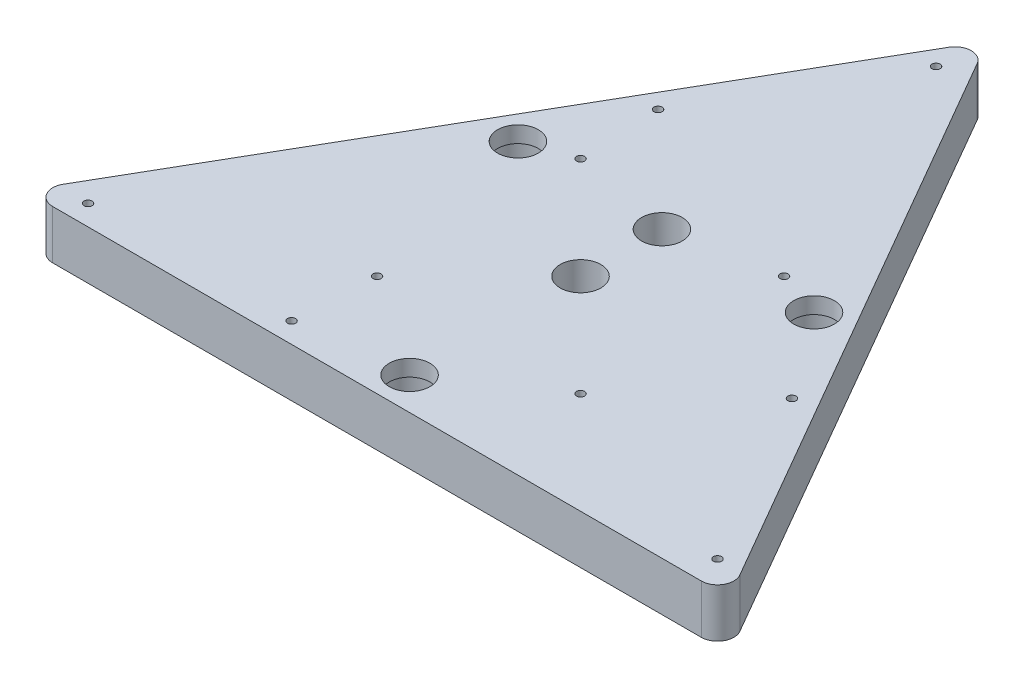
from build123d import *

# Parameters (mm, degrees)
ESQUISSE1_R             = 2.5
ESQUISSE1_R_2           = 0.5
EXTRUSION1_DEPTH        = 6
CONG_1_R                = 2
ESQUISSE2_R             = 3.25
ENL_V_MAT_EXTRU_1_DEPTH = 4


with BuildPart() as part:
    # Esquisse1 → Extrusion1 (new body)
    with BuildSketch(Plane(origin=(0, 0, 0), x_dir=(1, 0, 0), z_dir=(0, 1, 0))):
        Polygon((0, 50), (-43.301270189, -25), (43.301270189, -25), align=None)
        with Locations(Location((0, 0, 0), (0, 0, 270))):
            Circle(ESQUISSE1_R, mode=Mode.SUBTRACT)
        with Locations(Location((-18.186533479, 10.5, 0), (0, 0, 270))):
            Circle(ESQUISSE1_R, mode=Mode.SUBTRACT)
        with Locations(Location((0, -21, 0), (0, 0, 270))):
            Circle(ESQUISSE1_R, mode=Mode.SUBTRACT)
        with Locations(Location((18.186533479, 10.5, 0), (0, 0, 270))):
            Circle(ESQUISSE1_R, mode=Mode.SUBTRACT)
        with Locations(Location((38.485571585, -21.658965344, 0), (0, 0, 270))):
            Circle(ESQUISSE1_R_2, mode=Mode.SUBTRACT)
        with Locations(Location((25.985571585, -0.008330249, 0), (0, 0, 270))):
            Circle(ESQUISSE1_R_2, mode=Mode.SUBTRACT)
        with Locations(Location((-0.485571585, 44.158965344, 0), (0, 0, 270))):
            Circle(ESQUISSE1_R_2, mode=Mode.SUBTRACT)
        with Locations(Location((-12.985571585, 22.508330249, 0), (0, 0, 270))):
            Circle(ESQUISSE1_R_2, mode=Mode.SUBTRACT)
        with Locations(Location((0, 10, 0), (0, 0, 270))):
            Circle(ESQUISSE1_R, mode=Mode.SUBTRACT)
        with Locations(Location((-38, -22.5, 0), (0, 0, 270))):
            Circle(ESQUISSE1_R_2, mode=Mode.SUBTRACT)
        with Locations(Location((-13, -22.5, 0), (0, 0, 270))):
            Circle(ESQUISSE1_R_2, mode=Mode.SUBTRACT)
        with Locations(Location((12.5, 12.5, 0), (0, 0, 270))):
            Circle(ESQUISSE1_R_2, mode=Mode.SUBTRACT)
        with Locations(Location((-12.5, 12.5, 0), (0, 0, 270))):
            Circle(ESQUISSE1_R_2, mode=Mode.SUBTRACT)
        with Locations(Location((-12.5, -12.5, 0), (0, 0, 270))):
            Circle(ESQUISSE1_R_2, mode=Mode.SUBTRACT)
        with Locations(Location((12.5, -12.5, 0), (0, 0, 270))):
            Circle(ESQUISSE1_R_2, mode=Mode.SUBTRACT)
    extrude(amount=-EXTRUSION1_DEPTH)

    # Cong_1
    cong_1_edges = [part.edges().sort_by_distance(p)[0] for p in [
        (43.301270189, -3, 25),
        (-43.301270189, -3, 25),
        (0, -3, -50),
    ]]
    fillet(cong_1_edges, radius=CONG_1_R)

    # Esquisse2 → Enl_v. mat.-Extru.1 (cut)
    with BuildSketch(Plane(origin=(0, -6, 0), x_dir=(-1, 0, 0), z_dir=(0, 1, 0))):
        with Locations(Location((0, 20.98397833, 0), (0, 0, 90))):
            Circle(ESQUISSE2_R)
        with Locations(Location((-18.172658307, -10.491989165, 0), (0, 0, 90))):
            Circle(ESQUISSE2_R)
        with Locations(Location((18.172658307, -10.491989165, 0), (0, 0, 90))):
            Circle(ESQUISSE2_R)
    extrude(amount=ENL_V_MAT_EXTRU_1_DEPTH, mode=Mode.SUBTRACT)


solid = part.part
